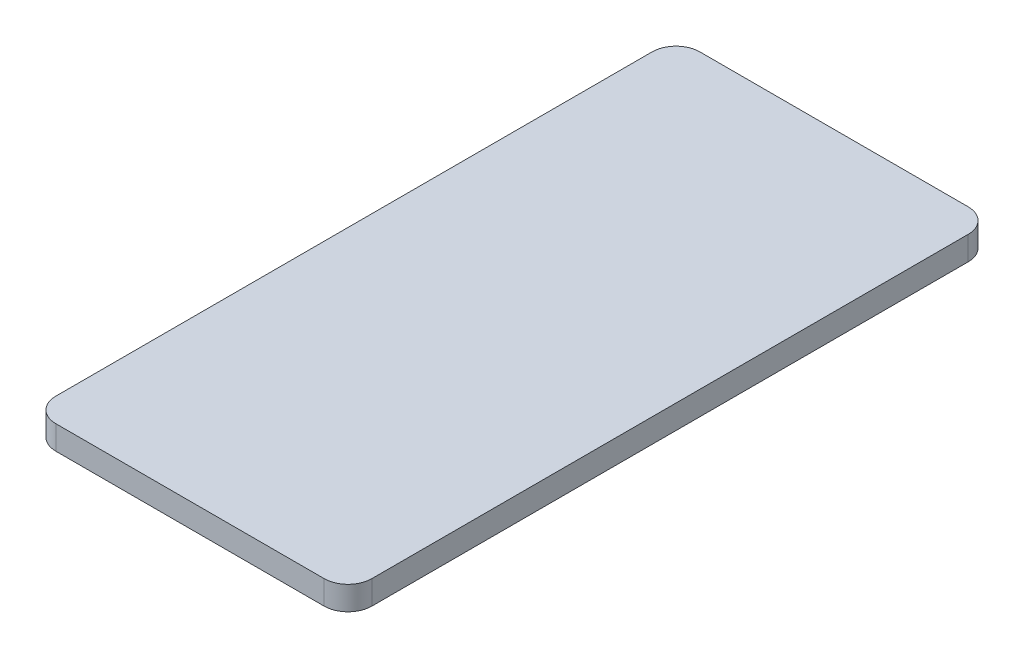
ISO-10303-21;
HEADER;
FILE_DESCRIPTION(('STEP AP214'),'2;1');
FILE_NAME('part.step','',(''),(''),'','','');
FILE_SCHEMA(('AUTOMOTIVE_DESIGN { 1 0 10303 214 1 1 1 1 }'));
ENDSEC;
DATA;
#1=APPLICATION_CONTEXT('core data for automotive mechanical design processes');
#2=APPLICATION_PROTOCOL_DEFINITION('international standard','automotive_design',2000,#1);
#3=PRODUCT_CONTEXT('',#1,'mechanical');
#4=PRODUCT('Part','Part','',(#3));
#5=PRODUCT_RELATED_PRODUCT_CATEGORY('part','',(#4));
#6=PRODUCT_DEFINITION_FORMATION('','',#4);
#7=PRODUCT_DEFINITION_CONTEXT('part definition',#1,'design');
#8=PRODUCT_DEFINITION('design','',#6,#7);
#9=PRODUCT_DEFINITION_SHAPE('','',#8);
#10=(LENGTH_UNIT() NAMED_UNIT(*) SI_UNIT(.MILLI.,.METRE.));
#11=(NAMED_UNIT(*) PLANE_ANGLE_UNIT() SI_UNIT($,.RADIAN.));
#12=(NAMED_UNIT(*) SI_UNIT($,.STERADIAN.) SOLID_ANGLE_UNIT());
#13=UNCERTAINTY_MEASURE_WITH_UNIT(LENGTH_MEASURE(1.E-05),#10,'distance_accuracy_value','');
#14=(GEOMETRIC_REPRESENTATION_CONTEXT(3) GLOBAL_UNCERTAINTY_ASSIGNED_CONTEXT((#13)) GLOBAL_UNIT_ASSIGNED_CONTEXT((#10,
#11,#12)) REPRESENTATION_CONTEXT('',''));
#15=CARTESIAN_POINT('',(0.,0.,0.));
#16=DIRECTION('',(0.,0.,1.));
#17=DIRECTION('',(1.,0.,0.));
#18=AXIS2_PLACEMENT_3D('',#15,#16,#17);
#19=CARTESIAN_POINT('',(-11.25,2.,-25.));
#20=DIRECTION('',(0.,-1.,0.));
#21=DIRECTION('',(0.,0.,-1.));
#22=AXIS2_PLACEMENT_3D('',#19,#20,#21);
#23=CYLINDRICAL_SURFACE('',#22,2.);
#24=CARTESIAN_POINT('',(-11.25,0.,-25.));
#25=DIRECTION('',(0.,1.,0.));
#26=DIRECTION('',(0.,0.,1.));
#27=AXIS2_PLACEMENT_3D('',#24,#25,#26);
#28=CIRCLE('',#27,2.);
#29=CARTESIAN_POINT('',(-11.25,0.,-27.));
#30=VERTEX_POINT('',#29);
#31=CARTESIAN_POINT('',(-13.25,0.,-25.));
#32=VERTEX_POINT('',#31);
#33=EDGE_CURVE('E139',#30,#32,#28,.T.);
#34=ORIENTED_EDGE('',*,*,#33,.T.);
#35=DIRECTION('',(0.,-1.,0.));
#36=VECTOR('',#35,1.);
#37=CARTESIAN_POINT('',(-13.25,2.,-25.));
#38=LINE('',#37,#36);
#39=CARTESIAN_POINT('',(-13.25,2.,-25.));
#40=VERTEX_POINT('',#39);
#41=EDGE_CURVE('E11',#40,#32,#38,.T.);
#42=ORIENTED_EDGE('',*,*,#41,.F.);
#43=CARTESIAN_POINT('',(-11.25,2.,-25.));
#44=DIRECTION('',(0.,1.,0.));
#45=DIRECTION('',(0.,0.,1.));
#46=AXIS2_PLACEMENT_3D('',#43,#44,#45);
#47=CIRCLE('',#46,2.);
#48=CARTESIAN_POINT('',(-11.25,2.,-27.));
#49=VERTEX_POINT('',#48);
#50=EDGE_CURVE('E153',#49,#40,#47,.T.);
#51=ORIENTED_EDGE('',*,*,#50,.F.);
#52=DIRECTION('',(0.,-1.,0.));
#53=VECTOR('',#52,1.);
#54=CARTESIAN_POINT('',(-11.25,2.,-27.));
#55=LINE('',#54,#53);
#56=EDGE_CURVE('E135',#49,#30,#55,.T.);
#57=ORIENTED_EDGE('',*,*,#56,.T.);
#58=EDGE_LOOP('',(#34,#42,#51,#57));
#59=FACE_BOUND('',#58,.T.);
#60=ADVANCED_FACE('F43',(#59),#23,.T.);
#61=CARTESIAN_POINT('',(-13.25,2.,25.));
#62=DIRECTION('',(1.,0.,0.));
#63=DIRECTION('',(0.,0.,-1.));
#64=AXIS2_PLACEMENT_3D('',#61,#62,#63);
#65=PLANE('',#64);
#66=DIRECTION('',(0.,0.,1.));
#67=VECTOR('',#66,1.);
#68=CARTESIAN_POINT('',(-13.25,0.,25.));
#69=LINE('',#68,#67);
#70=CARTESIAN_POINT('',(-13.25,0.,25.));
#71=VERTEX_POINT('',#70);
#72=EDGE_CURVE('E142',#32,#71,#69,.T.);
#73=ORIENTED_EDGE('',*,*,#72,.T.);
#74=DIRECTION('',(0.,-1.,0.));
#75=VECTOR('',#74,1.);
#76=CARTESIAN_POINT('',(-13.25,2.,25.));
#77=LINE('',#76,#75);
#78=CARTESIAN_POINT('',(-13.25,2.,25.));
#79=VERTEX_POINT('',#78);
#80=EDGE_CURVE('E51',#79,#71,#77,.T.);
#81=ORIENTED_EDGE('',*,*,#80,.F.);
#82=DIRECTION('',(0.,0.,1.));
#83=VECTOR('',#82,1.);
#84=CARTESIAN_POINT('',(-13.25,2.,25.));
#85=LINE('',#84,#83);
#86=EDGE_CURVE('E102',#40,#79,#85,.T.);
#87=ORIENTED_EDGE('',*,*,#86,.F.);
#88=ORIENTED_EDGE('',*,*,#41,.T.);
#89=EDGE_LOOP('',(#73,#81,#87,#88));
#90=FACE_BOUND('',#89,.T.);
#91=ADVANCED_FACE('F188',(#90),#65,.F.);
#92=CARTESIAN_POINT('',(-11.25,2.,25.));
#93=DIRECTION('',(0.,-1.,0.));
#94=DIRECTION('',(0.,0.,-1.));
#95=AXIS2_PLACEMENT_3D('',#92,#93,#94);
#96=CYLINDRICAL_SURFACE('',#95,2.);
#97=CARTESIAN_POINT('',(-11.25,0.,25.));
#98=DIRECTION('',(0.,1.,0.));
#99=DIRECTION('',(0.,0.,-1.));
#100=AXIS2_PLACEMENT_3D('',#97,#98,#99);
#101=CIRCLE('',#100,2.);
#102=CARTESIAN_POINT('',(-11.25,0.,27.));
#103=VERTEX_POINT('',#102);
#104=EDGE_CURVE('E144',#71,#103,#101,.T.);
#105=ORIENTED_EDGE('',*,*,#104,.T.);
#106=DIRECTION('',(0.,-1.,0.));
#107=VECTOR('',#106,1.);
#108=CARTESIAN_POINT('',(-11.25,2.,27.));
#109=LINE('',#108,#107);
#110=CARTESIAN_POINT('',(-11.25,2.,27.));
#111=VERTEX_POINT('',#110);
#112=EDGE_CURVE('E160',#111,#103,#109,.T.);
#113=ORIENTED_EDGE('',*,*,#112,.F.);
#114=CARTESIAN_POINT('',(-11.25,2.,25.));
#115=DIRECTION('',(0.,1.,0.));
#116=DIRECTION('',(0.,0.,-1.));
#117=AXIS2_PLACEMENT_3D('',#114,#115,#116);
#118=CIRCLE('',#117,2.);
#119=EDGE_CURVE('E168',#79,#111,#118,.T.);
#120=ORIENTED_EDGE('',*,*,#119,.F.);
#121=ORIENTED_EDGE('',*,*,#80,.T.);
#122=EDGE_LOOP('',(#105,#113,#120,#121));
#123=FACE_BOUND('',#122,.T.);
#124=ADVANCED_FACE('F166',(#123),#96,.T.);
#125=CARTESIAN_POINT('',(11.25,2.,27.));
#126=DIRECTION('',(0.,0.,-1.));
#127=DIRECTION('',(-1.,0.,0.));
#128=AXIS2_PLACEMENT_3D('',#125,#126,#127);
#129=PLANE('',#128);
#130=DIRECTION('',(1.,0.,0.));
#131=VECTOR('',#130,1.);
#132=CARTESIAN_POINT('',(11.25,0.,27.));
#133=LINE('',#132,#131);
#134=CARTESIAN_POINT('',(11.25,0.,27.));
#135=VERTEX_POINT('',#134);
#136=EDGE_CURVE('E146',#103,#135,#133,.T.);
#137=ORIENTED_EDGE('',*,*,#136,.T.);
#138=DIRECTION('',(0.,-1.,0.));
#139=VECTOR('',#138,1.);
#140=CARTESIAN_POINT('',(11.25,2.,27.));
#141=LINE('',#140,#139);
#142=CARTESIAN_POINT('',(11.25,2.,27.));
#143=VERTEX_POINT('',#142);
#144=EDGE_CURVE('E157',#143,#135,#141,.T.);
#145=ORIENTED_EDGE('',*,*,#144,.F.);
#146=DIRECTION('',(1.,0.,0.));
#147=VECTOR('',#146,1.);
#148=CARTESIAN_POINT('',(11.25,2.,27.));
#149=LINE('',#148,#147);
#150=EDGE_CURVE('E180',#111,#143,#149,.T.);
#151=ORIENTED_EDGE('',*,*,#150,.F.);
#152=ORIENTED_EDGE('',*,*,#112,.T.);
#153=EDGE_LOOP('',(#137,#145,#151,#152));
#154=FACE_BOUND('',#153,.T.);
#155=ADVANCED_FACE('F176',(#154),#129,.F.);
#156=CARTESIAN_POINT('',(11.25,2.,25.));
#157=DIRECTION('',(0.,-1.,0.));
#158=DIRECTION('',(0.,0.,-1.));
#159=AXIS2_PLACEMENT_3D('',#156,#157,#158);
#160=CYLINDRICAL_SURFACE('',#159,2.);
#161=CARTESIAN_POINT('',(11.25,0.,25.));
#162=DIRECTION('',(0.,1.,0.));
#163=DIRECTION('',(0.,0.,-1.));
#164=AXIS2_PLACEMENT_3D('',#161,#162,#163);
#165=CIRCLE('',#164,2.);
#166=CARTESIAN_POINT('',(13.25,0.,25.));
#167=VERTEX_POINT('',#166);
#168=EDGE_CURVE('E148',#135,#167,#165,.T.);
#169=ORIENTED_EDGE('',*,*,#168,.T.);
#170=DIRECTION('',(0.,-1.,0.));
#171=VECTOR('',#170,1.);
#172=CARTESIAN_POINT('',(13.25,2.,25.));
#173=LINE('',#172,#171);
#174=CARTESIAN_POINT('',(13.25,2.,25.));
#175=VERTEX_POINT('',#174);
#176=EDGE_CURVE('E130',#175,#167,#173,.T.);
#177=ORIENTED_EDGE('',*,*,#176,.F.);
#178=CARTESIAN_POINT('',(11.25,2.,25.));
#179=DIRECTION('',(0.,1.,0.));
#180=DIRECTION('',(0.,0.,-1.));
#181=AXIS2_PLACEMENT_3D('',#178,#179,#180);
#182=CIRCLE('',#181,2.);
#183=EDGE_CURVE('E121',#143,#175,#182,.T.);
#184=ORIENTED_EDGE('',*,*,#183,.F.);
#185=ORIENTED_EDGE('',*,*,#144,.T.);
#186=EDGE_LOOP('',(#169,#177,#184,#185));
#187=FACE_BOUND('',#186,.T.);
#188=ADVANCED_FACE('F179',(#187),#160,.T.);
#189=CARTESIAN_POINT('',(13.25,2.,25.));
#190=DIRECTION('',(-1.,0.,0.));
#191=DIRECTION('',(0.,0.,1.));
#192=AXIS2_PLACEMENT_3D('',#189,#190,#191);
#193=PLANE('',#192);
#194=DIRECTION('',(0.,0.,-1.));
#195=VECTOR('',#194,1.);
#196=CARTESIAN_POINT('',(13.25,0.,25.));
#197=LINE('',#196,#195);
#198=CARTESIAN_POINT('',(13.25,0.,-25.));
#199=VERTEX_POINT('',#198);
#200=EDGE_CURVE('E129',#167,#199,#197,.T.);
#201=ORIENTED_EDGE('',*,*,#200,.T.);
#202=DIRECTION('',(0.,-1.,0.));
#203=VECTOR('',#202,1.);
#204=CARTESIAN_POINT('',(13.25,2.,-25.));
#205=LINE('',#204,#203);
#206=CARTESIAN_POINT('',(13.25,2.,-25.));
#207=VERTEX_POINT('',#206);
#208=EDGE_CURVE('E126',#207,#199,#205,.T.);
#209=ORIENTED_EDGE('',*,*,#208,.F.);
#210=DIRECTION('',(0.,0.,-1.));
#211=VECTOR('',#210,1.);
#212=CARTESIAN_POINT('',(13.25,2.,25.));
#213=LINE('',#212,#211);
#214=EDGE_CURVE('E115',#175,#207,#213,.T.);
#215=ORIENTED_EDGE('',*,*,#214,.F.);
#216=ORIENTED_EDGE('',*,*,#176,.T.);
#217=EDGE_LOOP('',(#201,#209,#215,#216));
#218=FACE_BOUND('',#217,.T.);
#219=ADVANCED_FACE('F127',(#218),#193,.F.);
#220=CARTESIAN_POINT('',(11.25,2.,-25.));
#221=DIRECTION('',(0.,-1.,0.));
#222=DIRECTION('',(0.,0.,-1.));
#223=AXIS2_PLACEMENT_3D('',#220,#221,#222);
#224=CYLINDRICAL_SURFACE('',#223,2.);
#225=CARTESIAN_POINT('',(11.25,0.,-25.));
#226=DIRECTION('',(0.,1.,0.));
#227=DIRECTION('',(0.,0.,1.));
#228=AXIS2_PLACEMENT_3D('',#225,#226,#227);
#229=CIRCLE('',#228,2.);
#230=CARTESIAN_POINT('',(11.25,0.,-27.));
#231=VERTEX_POINT('',#230);
#232=EDGE_CURVE('E88',#199,#231,#229,.T.);
#233=ORIENTED_EDGE('',*,*,#232,.T.);
#234=DIRECTION('',(0.,-1.,0.));
#235=VECTOR('',#234,1.);
#236=CARTESIAN_POINT('',(11.25,2.,-27.));
#237=LINE('',#236,#235);
#238=CARTESIAN_POINT('',(11.25,2.,-27.));
#239=VERTEX_POINT('',#238);
#240=EDGE_CURVE('E131',#239,#231,#237,.T.);
#241=ORIENTED_EDGE('',*,*,#240,.F.);
#242=CARTESIAN_POINT('',(11.25,2.,-25.));
#243=DIRECTION('',(0.,1.,0.));
#244=DIRECTION('',(0.,0.,1.));
#245=AXIS2_PLACEMENT_3D('',#242,#243,#244);
#246=CIRCLE('',#245,2.);
#247=EDGE_CURVE('E119',#207,#239,#246,.T.);
#248=ORIENTED_EDGE('',*,*,#247,.F.);
#249=ORIENTED_EDGE('',*,*,#208,.T.);
#250=EDGE_LOOP('',(#233,#241,#248,#249));
#251=FACE_BOUND('',#250,.T.);
#252=ADVANCED_FACE('F133',(#251),#224,.T.);
#253=CARTESIAN_POINT('',(11.25,2.,-27.));
#254=DIRECTION('',(0.,0.,1.));
#255=DIRECTION('',(1.,0.,0.));
#256=AXIS2_PLACEMENT_3D('',#253,#254,#255);
#257=PLANE('',#256);
#258=DIRECTION('',(-1.,0.,0.));
#259=VECTOR('',#258,1.);
#260=CARTESIAN_POINT('',(11.25,0.,-27.));
#261=LINE('',#260,#259);
#262=EDGE_CURVE('E94',#231,#30,#261,.T.);
#263=ORIENTED_EDGE('',*,*,#262,.T.);
#264=ORIENTED_EDGE('',*,*,#56,.F.);
#265=DIRECTION('',(-1.,0.,0.));
#266=VECTOR('',#265,1.);
#267=CARTESIAN_POINT('',(11.25,2.,-27.));
#268=LINE('',#267,#266);
#269=EDGE_CURVE('E59',#239,#49,#268,.T.);
#270=ORIENTED_EDGE('',*,*,#269,.F.);
#271=ORIENTED_EDGE('',*,*,#240,.T.);
#272=EDGE_LOOP('',(#263,#264,#270,#271));
#273=FACE_BOUND('',#272,.T.);
#274=ADVANCED_FACE('F204',(#273),#257,.F.);
#275=CARTESIAN_POINT('',(-11.25,2.,-25.));
#276=DIRECTION('',(0.,1.,0.));
#277=DIRECTION('',(0.,0.,1.));
#278=AXIS2_PLACEMENT_3D('',#275,#276,#277);
#279=PLANE('',#278);
#280=ORIENTED_EDGE('',*,*,#50,.T.);
#281=ORIENTED_EDGE('',*,*,#86,.T.);
#282=ORIENTED_EDGE('',*,*,#119,.T.);
#283=ORIENTED_EDGE('',*,*,#150,.T.);
#284=ORIENTED_EDGE('',*,*,#183,.T.);
#285=ORIENTED_EDGE('',*,*,#214,.T.);
#286=ORIENTED_EDGE('',*,*,#247,.T.);
#287=ORIENTED_EDGE('',*,*,#269,.T.);
#288=EDGE_LOOP('',(#280,#281,#282,#283,#284,#285,#286,#287));
#289=FACE_BOUND('',#288,.T.);
#290=ADVANCED_FACE('F117',(#289),#279,.T.);
#291=CARTESIAN_POINT('',(-11.25,0.,-25.));
#292=DIRECTION('',(0.,1.,0.));
#293=DIRECTION('',(0.,0.,1.));
#294=AXIS2_PLACEMENT_3D('',#291,#292,#293);
#295=PLANE('',#294);
#296=ORIENTED_EDGE('',*,*,#33,.F.);
#297=ORIENTED_EDGE('',*,*,#262,.F.);
#298=ORIENTED_EDGE('',*,*,#232,.F.);
#299=ORIENTED_EDGE('',*,*,#200,.F.);
#300=ORIENTED_EDGE('',*,*,#168,.F.);
#301=ORIENTED_EDGE('',*,*,#136,.F.);
#302=ORIENTED_EDGE('',*,*,#104,.F.);
#303=ORIENTED_EDGE('',*,*,#72,.F.);
#304=EDGE_LOOP('',(#296,#297,#298,#299,#300,#301,#302,#303));
#305=FACE_BOUND('',#304,.T.);
#306=ADVANCED_FACE('F172',(#305),#295,.F.);
#307=CLOSED_SHELL('',(#60,#91,#124,#155,#188,#219,#252,#274,#290,#306));
#308=MANIFOLD_SOLID_BREP('B2',#307);
#309=ADVANCED_BREP_SHAPE_REPRESENTATION('',(#18,#308),#14);
#310=SHAPE_DEFINITION_REPRESENTATION(#9,#309);
ENDSEC;
END-ISO-10303-21;
